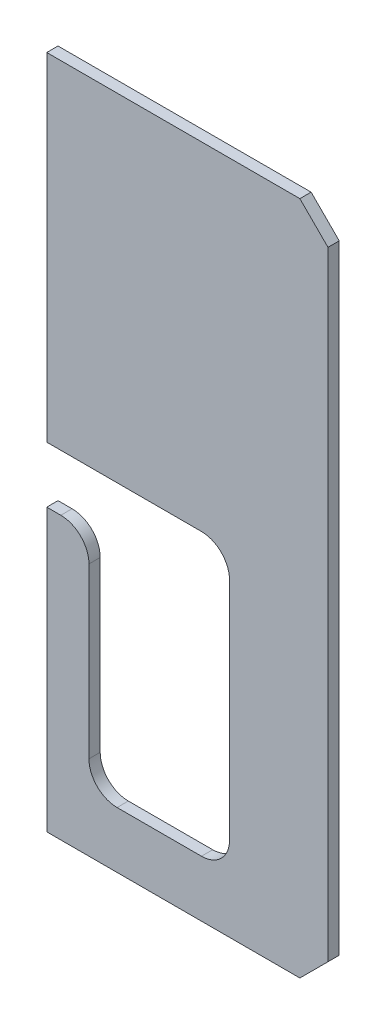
from build123d import *

# Parameters (mm, degrees)
EXTRUSION1_DEPTH = 4


with BuildPart() as part:
    # Esquisse1 → Extrusion1 (new body)
    with BuildSketch(Plane.XY):
        with BuildLine():
            Line((55, 120), (0, 120))
            Line((0, 120), (0, 240))
            Line((0, 240), (90, 240))
            Line((90, 240), (100, 230))
            Line((100, 230), (100, 10))
            Line((100, 10), (90, 0))
            Line((90, 0), (0, 0))
            Line((0, 0), (0, 100))
            Line((0, 100), (5, 100))
            ThreePointArc((5, 100), (12.071067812, 97.071067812), (15, 90))
            Line((15, 90), (15, 30))
            ThreePointArc((15, 30), (17.928932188, 22.928932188), (25, 20))
            Line((25, 20), (55, 20))
            ThreePointArc((55, 20), (62.071067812, 22.928932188), (65, 30))
            Line((65, 30), (65, 110))
            ThreePointArc((65, 110), (62.071067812, 117.071067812), (55, 120))
        make_face()
    extrude(amount=EXTRUSION1_DEPTH)


solid = part.part
